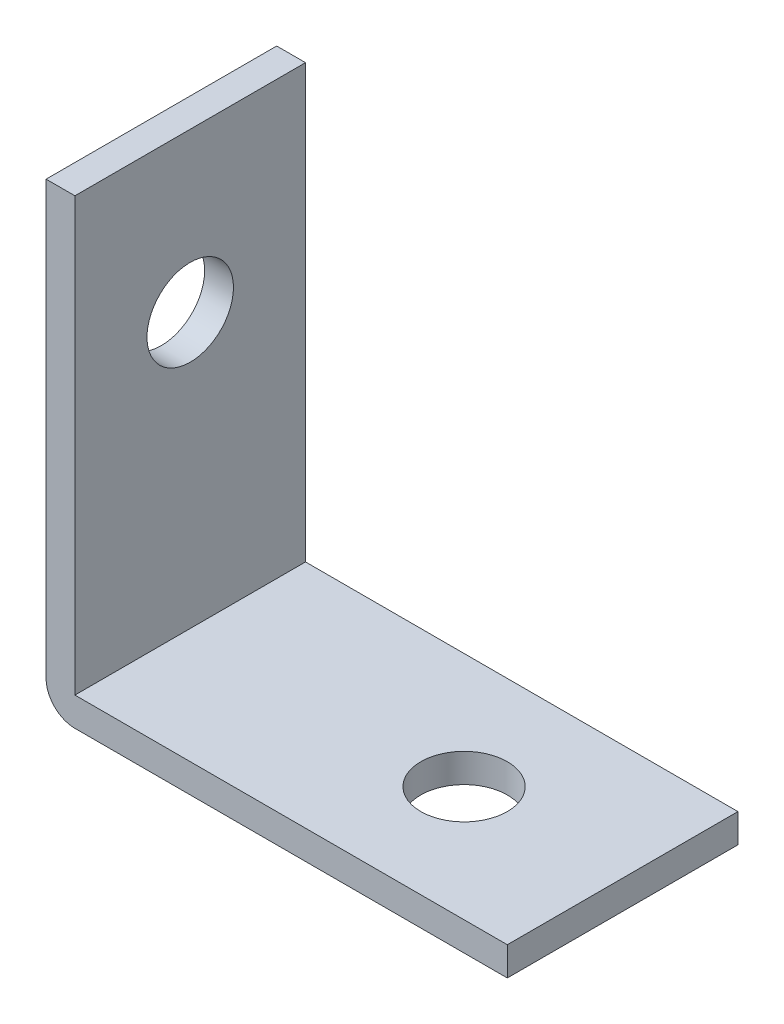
ISO-10303-21;
HEADER;
FILE_DESCRIPTION(('STEP AP214'),'2;1');
FILE_NAME('part.step','',(''),(''),'','','');
FILE_SCHEMA(('AUTOMOTIVE_DESIGN { 1 0 10303 214 1 1 1 1 }'));
ENDSEC;
DATA;
#1=APPLICATION_CONTEXT('core data for automotive mechanical design processes');
#2=APPLICATION_PROTOCOL_DEFINITION('international standard','automotive_design',2000,#1);
#3=PRODUCT_CONTEXT('',#1,'mechanical');
#4=PRODUCT('Part','Part','',(#3));
#5=PRODUCT_RELATED_PRODUCT_CATEGORY('part','',(#4));
#6=PRODUCT_DEFINITION_FORMATION('','',#4);
#7=PRODUCT_DEFINITION_CONTEXT('part definition',#1,'design');
#8=PRODUCT_DEFINITION('design','',#6,#7);
#9=PRODUCT_DEFINITION_SHAPE('','',#8);
#10=(LENGTH_UNIT() NAMED_UNIT(*) SI_UNIT(.MILLI.,.METRE.));
#11=(NAMED_UNIT(*) PLANE_ANGLE_UNIT() SI_UNIT($,.RADIAN.));
#12=(NAMED_UNIT(*) SI_UNIT($,.STERADIAN.) SOLID_ANGLE_UNIT());
#13=UNCERTAINTY_MEASURE_WITH_UNIT(LENGTH_MEASURE(1.E-05),#10,'distance_accuracy_value','');
#14=(GEOMETRIC_REPRESENTATION_CONTEXT(3) GLOBAL_UNCERTAINTY_ASSIGNED_CONTEXT((#13)) GLOBAL_UNIT_ASSIGNED_CONTEXT((#10,
#11,#12)) REPRESENTATION_CONTEXT('',''));
#15=CARTESIAN_POINT('',(0.,0.,0.));
#16=DIRECTION('',(0.,0.,1.));
#17=DIRECTION('',(1.,0.,0.));
#18=AXIS2_PLACEMENT_3D('',#15,#16,#17);
#19=CARTESIAN_POINT('',(0.,0.,0.));
#20=DIRECTION('',(0.,-1.,0.));
#21=DIRECTION('',(0.,0.,-1.));
#22=AXIS2_PLACEMENT_3D('',#19,#20,#21);
#23=PLANE('',#22);
#24=CARTESIAN_POINT('',(16.66875,0.,0.));
#25=DIRECTION('',(0.,1.,0.));
#26=DIRECTION('',(0.,0.,1.));
#27=AXIS2_PLACEMENT_3D('',#24,#25,#26);
#28=CIRCLE('',#27,2.38125);
#29=CARTESIAN_POINT('',(16.66875,0.,2.38125));
#30=VERTEX_POINT('',#29);
#31=EDGE_CURVE('E139',#30,#30,#28,.T.);
#32=ORIENTED_EDGE('',*,*,#31,.F.);
#33=EDGE_LOOP('',(#32));
#34=FACE_BOUND('',#33,.T.);
#35=DIRECTION('',(0.,0.,-1.));
#36=VECTOR('',#35,1.);
#37=CARTESIAN_POINT('',(1.5875,0.,-6.35));
#38=LINE('',#37,#36);
#39=CARTESIAN_POINT('',(1.5875,0.,6.35));
#40=VERTEX_POINT('',#39);
#41=CARTESIAN_POINT('',(1.5875,0.,-6.35));
#42=VERTEX_POINT('',#41);
#43=EDGE_CURVE('E124',#40,#42,#38,.T.);
#44=ORIENTED_EDGE('',*,*,#43,.F.);
#45=DIRECTION('',(1.,0.,0.));
#46=VECTOR('',#45,1.);
#47=CARTESIAN_POINT('',(0.,0.,6.35));
#48=LINE('',#47,#46);
#49=CARTESIAN_POINT('',(25.4,0.,6.34999999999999));
#50=VERTEX_POINT('',#49);
#51=EDGE_CURVE('E155',#40,#50,#48,.T.);
#52=ORIENTED_EDGE('',*,*,#51,.T.);
#53=DIRECTION('',(0.,0.,-1.));
#54=VECTOR('',#53,1.);
#55=CARTESIAN_POINT('',(25.4,0.,-6.35000000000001));
#56=LINE('',#55,#54);
#57=CARTESIAN_POINT('',(25.4,0.,-6.35000000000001));
#58=VERTEX_POINT('',#57);
#59=EDGE_CURVE('E149',#50,#58,#56,.T.);
#60=ORIENTED_EDGE('',*,*,#59,.T.);
#61=DIRECTION('',(-1.,0.,0.));
#62=VECTOR('',#61,1.);
#63=CARTESIAN_POINT('',(0.,0.,-6.35));
#64=LINE('',#63,#62);
#65=EDGE_CURVE('E143',#58,#42,#64,.T.);
#66=ORIENTED_EDGE('',*,*,#65,.T.);
#67=EDGE_LOOP('',(#44,#52,#60,#66));
#68=FACE_BOUND('',#67,.T.);
#69=ADVANCED_FACE('F41',(#34,#68),#23,.F.);
#70=CARTESIAN_POINT('',(0.,-1.5875,-6.35));
#71=DIRECTION('',(0.,0.,-1.));
#72=DIRECTION('',(-1.,0.,0.));
#73=AXIS2_PLACEMENT_3D('',#70,#71,#72);
#74=PLANE('',#73);
#75=DIRECTION('',(-1.,0.,0.));
#76=VECTOR('',#75,1.);
#77=CARTESIAN_POINT('',(0.,-1.5875,-6.35));
#78=LINE('',#77,#76);
#79=CARTESIAN_POINT('',(25.4,-1.5875,-6.35000000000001));
#80=VERTEX_POINT('',#79);
#81=CARTESIAN_POINT('',(1.5875,-1.5875,-6.35));
#82=VERTEX_POINT('',#81);
#83=EDGE_CURVE('E146',#80,#82,#78,.T.);
#84=ORIENTED_EDGE('',*,*,#83,.T.);
#85=CARTESIAN_POINT('',(1.5875,0.,-6.35));
#86=DIRECTION('',(0.,0.,-1.));
#87=DIRECTION('',(-1.,0.,0.));
#88=AXIS2_PLACEMENT_3D('',#85,#86,#87);
#89=CIRCLE('',#88,1.5875);
#90=CARTESIAN_POINT('',(0.,0.,-6.35));
#91=VERTEX_POINT('',#90);
#92=EDGE_CURVE('E11',#82,#91,#89,.T.);
#93=ORIENTED_EDGE('',*,*,#92,.T.);
#94=DIRECTION('',(0.,1.,0.));
#95=VECTOR('',#94,1.);
#96=CARTESIAN_POINT('',(0.,-1.5875,-6.35));
#97=LINE('',#96,#95);
#98=CARTESIAN_POINT('',(0.,23.8125,-6.35));
#99=VERTEX_POINT('',#98);
#100=EDGE_CURVE('E108',#91,#99,#97,.T.);
#101=ORIENTED_EDGE('',*,*,#100,.T.);
#102=DIRECTION('',(-1.,0.,0.));
#103=VECTOR('',#102,1.);
#104=CARTESIAN_POINT('',(0.,23.8125,-6.35));
#105=LINE('',#104,#103);
#106=CARTESIAN_POINT('',(1.5875,23.8125,-6.35));
#107=VERTEX_POINT('',#106);
#108=EDGE_CURVE('E123',#107,#99,#105,.T.);
#109=ORIENTED_EDGE('',*,*,#108,.F.);
#110=DIRECTION('',(0.,-1.,0.));
#111=VECTOR('',#110,1.);
#112=CARTESIAN_POINT('',(1.5875,23.8125,-6.35));
#113=LINE('',#112,#111);
#114=EDGE_CURVE('E134',#107,#42,#113,.T.);
#115=ORIENTED_EDGE('',*,*,#114,.T.);
#116=ORIENTED_EDGE('',*,*,#65,.F.);
#117=DIRECTION('',(0.,1.,0.));
#118=VECTOR('',#117,1.);
#119=CARTESIAN_POINT('',(25.4,-1.5875,-6.35000000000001));
#120=LINE('',#119,#118);
#121=EDGE_CURVE('E159',#80,#58,#120,.T.);
#122=ORIENTED_EDGE('',*,*,#121,.F.);
#123=EDGE_LOOP('',(#84,#93,#101,#109,#115,#116,#122));
#124=FACE_BOUND('',#123,.T.);
#125=ADVANCED_FACE('F166',(#124),#74,.T.);
#126=CARTESIAN_POINT('',(25.4,-1.5875,-6.35000000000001));
#127=DIRECTION('',(1.,0.,0.));
#128=DIRECTION('',(0.,0.,-1.));
#129=AXIS2_PLACEMENT_3D('',#126,#127,#128);
#130=PLANE('',#129);
#131=ORIENTED_EDGE('',*,*,#59,.F.);
#132=DIRECTION('',(0.,1.,0.));
#133=VECTOR('',#132,1.);
#134=CARTESIAN_POINT('',(25.4,-1.5875,6.34999999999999));
#135=LINE('',#134,#133);
#136=CARTESIAN_POINT('',(25.4,-1.5875,6.34999999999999));
#137=VERTEX_POINT('',#136);
#138=EDGE_CURVE('E107',#137,#50,#135,.T.);
#139=ORIENTED_EDGE('',*,*,#138,.F.);
#140=DIRECTION('',(0.,0.,-1.));
#141=VECTOR('',#140,1.);
#142=CARTESIAN_POINT('',(25.4,-1.5875,-6.35000000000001));
#143=LINE('',#142,#141);
#144=EDGE_CURVE('E151',#137,#80,#143,.T.);
#145=ORIENTED_EDGE('',*,*,#144,.T.);
#146=ORIENTED_EDGE('',*,*,#121,.T.);
#147=EDGE_LOOP('',(#131,#139,#145,#146));
#148=FACE_BOUND('',#147,.T.);
#149=ADVANCED_FACE('F182',(#148),#130,.T.);
#150=CARTESIAN_POINT('',(0.,-1.5875,6.35));
#151=DIRECTION('',(0.,0.,1.));
#152=DIRECTION('',(1.,0.,0.));
#153=AXIS2_PLACEMENT_3D('',#150,#151,#152);
#154=PLANE('',#153);
#155=DIRECTION('',(0.,1.,0.));
#156=VECTOR('',#155,1.);
#157=CARTESIAN_POINT('',(0.,-1.5875,6.35));
#158=LINE('',#157,#156);
#159=CARTESIAN_POINT('',(0.,0.,6.35));
#160=VERTEX_POINT('',#159);
#161=CARTESIAN_POINT('',(0.,23.8125,6.35));
#162=VERTEX_POINT('',#161);
#163=EDGE_CURVE('E99',#160,#162,#158,.T.);
#164=ORIENTED_EDGE('',*,*,#163,.F.);
#165=CARTESIAN_POINT('',(1.5875,0.,6.35));
#166=DIRECTION('',(0.,0.,1.));
#167=DIRECTION('',(1.,0.,0.));
#168=AXIS2_PLACEMENT_3D('',#165,#166,#167);
#169=CIRCLE('',#168,1.5875);
#170=CARTESIAN_POINT('',(1.5875,-1.5875,6.35));
#171=VERTEX_POINT('',#170);
#172=EDGE_CURVE('E63',#160,#171,#169,.T.);
#173=ORIENTED_EDGE('',*,*,#172,.T.);
#174=DIRECTION('',(1.,0.,0.));
#175=VECTOR('',#174,1.);
#176=CARTESIAN_POINT('',(0.,-1.5875,6.35));
#177=LINE('',#176,#175);
#178=EDGE_CURVE('E148',#171,#137,#177,.T.);
#179=ORIENTED_EDGE('',*,*,#178,.T.);
#180=ORIENTED_EDGE('',*,*,#138,.T.);
#181=ORIENTED_EDGE('',*,*,#51,.F.);
#182=DIRECTION('',(0.,-1.,0.));
#183=VECTOR('',#182,1.);
#184=CARTESIAN_POINT('',(1.5875,23.8125,6.35));
#185=LINE('',#184,#183);
#186=CARTESIAN_POINT('',(1.5875,23.8125,6.35));
#187=VERTEX_POINT('',#186);
#188=EDGE_CURVE('E115',#187,#40,#185,.T.);
#189=ORIENTED_EDGE('',*,*,#188,.F.);
#190=DIRECTION('',(1.,0.,0.));
#191=VECTOR('',#190,1.);
#192=CARTESIAN_POINT('',(0.,23.8125,6.35));
#193=LINE('',#192,#191);
#194=EDGE_CURVE('E111',#162,#187,#193,.T.);
#195=ORIENTED_EDGE('',*,*,#194,.F.);
#196=EDGE_LOOP('',(#164,#173,#179,#180,#181,#189,#195));
#197=FACE_BOUND('',#196,.T.);
#198=ADVANCED_FACE('F112',(#197),#154,.T.);
#199=CARTESIAN_POINT('',(0.,-1.5875,-6.35));
#200=DIRECTION('',(-1.,0.,0.));
#201=DIRECTION('',(0.,0.,1.));
#202=AXIS2_PLACEMENT_3D('',#199,#200,#201);
#203=PLANE('',#202);
#204=CARTESIAN_POINT('',(0.,15.08125,0.));
#205=DIRECTION('',(1.,0.,0.));
#206=DIRECTION('',(0.,0.,-1.));
#207=AXIS2_PLACEMENT_3D('',#204,#205,#206);
#208=CIRCLE('',#207,2.38125);
#209=CARTESIAN_POINT('',(0.,15.08125,-2.38125));
#210=VERTEX_POINT('',#209);
#211=EDGE_CURVE('E127',#210,#210,#208,.T.);
#212=ORIENTED_EDGE('',*,*,#211,.T.);
#213=EDGE_LOOP('',(#212));
#214=FACE_BOUND('',#213,.T.);
#215=ORIENTED_EDGE('',*,*,#100,.F.);
#216=DIRECTION('',(0.,0.,1.));
#217=VECTOR('',#216,1.);
#218=CARTESIAN_POINT('',(0.,0.,-6.35));
#219=LINE('',#218,#217);
#220=EDGE_CURVE('E106',#91,#160,#219,.T.);
#221=ORIENTED_EDGE('',*,*,#220,.T.);
#222=ORIENTED_EDGE('',*,*,#163,.T.);
#223=DIRECTION('',(0.,0.,1.));
#224=VECTOR('',#223,1.);
#225=CARTESIAN_POINT('',(0.,23.8125,-6.35));
#226=LINE('',#225,#224);
#227=EDGE_CURVE('E104',#99,#162,#226,.T.);
#228=ORIENTED_EDGE('',*,*,#227,.F.);
#229=EDGE_LOOP('',(#215,#221,#222,#228));
#230=FACE_BOUND('',#229,.T.);
#231=ADVANCED_FACE('F102',(#214,#230),#203,.T.);
#232=CARTESIAN_POINT('',(0.,-1.5875,0.));
#233=DIRECTION('',(0.,-1.,0.));
#234=DIRECTION('',(0.,0.,-1.));
#235=AXIS2_PLACEMENT_3D('',#232,#233,#234);
#236=PLANE('',#235);
#237=CARTESIAN_POINT('',(16.66875,-1.5875,0.));
#238=DIRECTION('',(0.,1.,0.));
#239=DIRECTION('',(0.,0.,1.));
#240=AXIS2_PLACEMENT_3D('',#237,#238,#239);
#241=CIRCLE('',#240,2.38125);
#242=CARTESIAN_POINT('',(16.66875,-1.5875,2.38125));
#243=VERTEX_POINT('',#242);
#244=EDGE_CURVE('E140',#243,#243,#241,.T.);
#245=ORIENTED_EDGE('',*,*,#244,.T.);
#246=EDGE_LOOP('',(#245));
#247=FACE_BOUND('',#246,.T.);
#248=ORIENTED_EDGE('',*,*,#178,.F.);
#249=DIRECTION('',(0.,0.,1.));
#250=VECTOR('',#249,1.);
#251=CARTESIAN_POINT('',(1.5875,-1.5875,0.));
#252=LINE('',#251,#250);
#253=EDGE_CURVE('E49',#171,#82,#252,.F.);
#254=ORIENTED_EDGE('',*,*,#253,.T.);
#255=ORIENTED_EDGE('',*,*,#83,.F.);
#256=ORIENTED_EDGE('',*,*,#144,.F.);
#257=EDGE_LOOP('',(#248,#254,#255,#256));
#258=FACE_BOUND('',#257,.T.);
#259=ADVANCED_FACE('F187',(#247,#258),#236,.T.);
#260=CARTESIAN_POINT('',(16.66875,-1.5875,0.));
#261=DIRECTION('',(0.,1.,0.));
#262=DIRECTION('',(0.,0.,1.));
#263=AXIS2_PLACEMENT_3D('',#260,#261,#262);
#264=CYLINDRICAL_SURFACE('',#263,2.38125);
#265=ORIENTED_EDGE('',*,*,#244,.F.);
#266=EDGE_LOOP('',(#265));
#267=FACE_BOUND('',#266,.T.);
#268=ORIENTED_EDGE('',*,*,#31,.T.);
#269=EDGE_LOOP('',(#268));
#270=FACE_BOUND('',#269,.T.);
#271=ADVANCED_FACE('F199',(#267,#270),#264,.F.);
#272=CARTESIAN_POINT('',(1.5875,23.8125,-6.35));
#273=DIRECTION('',(-1.,0.,0.));
#274=DIRECTION('',(0.,0.,1.));
#275=AXIS2_PLACEMENT_3D('',#272,#273,#274);
#276=PLANE('',#275);
#277=CARTESIAN_POINT('',(1.5875,15.08125,0.));
#278=DIRECTION('',(1.,0.,0.));
#279=DIRECTION('',(0.,0.,-1.));
#280=AXIS2_PLACEMENT_3D('',#277,#278,#279);
#281=CIRCLE('',#280,2.38125);
#282=CARTESIAN_POINT('',(1.5875,15.08125,-2.38125));
#283=VERTEX_POINT('',#282);
#284=EDGE_CURVE('E130',#283,#283,#281,.T.);
#285=ORIENTED_EDGE('',*,*,#284,.F.);
#286=EDGE_LOOP('',(#285));
#287=FACE_BOUND('',#286,.T.);
#288=ORIENTED_EDGE('',*,*,#43,.T.);
#289=ORIENTED_EDGE('',*,*,#114,.F.);
#290=DIRECTION('',(0.,0.,-1.));
#291=VECTOR('',#290,1.);
#292=CARTESIAN_POINT('',(1.5875,23.8125,-6.35));
#293=LINE('',#292,#291);
#294=EDGE_CURVE('E118',#187,#107,#293,.T.);
#295=ORIENTED_EDGE('',*,*,#294,.F.);
#296=ORIENTED_EDGE('',*,*,#188,.T.);
#297=EDGE_LOOP('',(#288,#289,#295,#296));
#298=FACE_BOUND('',#297,.T.);
#299=ADVANCED_FACE('F207',(#287,#298),#276,.F.);
#300=CARTESIAN_POINT('',(0.,23.8125,0.));
#301=DIRECTION('',(0.,1.,0.));
#302=DIRECTION('',(0.,0.,1.));
#303=AXIS2_PLACEMENT_3D('',#300,#301,#302);
#304=PLANE('',#303);
#305=ORIENTED_EDGE('',*,*,#227,.T.);
#306=ORIENTED_EDGE('',*,*,#194,.T.);
#307=ORIENTED_EDGE('',*,*,#294,.T.);
#308=ORIENTED_EDGE('',*,*,#108,.T.);
#309=EDGE_LOOP('',(#305,#306,#307,#308));
#310=FACE_BOUND('',#309,.T.);
#311=ADVANCED_FACE('F121',(#310),#304,.T.);
#312=CARTESIAN_POINT('',(0.,15.08125,0.));
#313=DIRECTION('',(1.,0.,0.));
#314=DIRECTION('',(0.,0.,-1.));
#315=AXIS2_PLACEMENT_3D('',#312,#313,#314);
#316=CYLINDRICAL_SURFACE('',#315,2.38125);
#317=ORIENTED_EDGE('',*,*,#211,.F.);
#318=EDGE_LOOP('',(#317));
#319=FACE_BOUND('',#318,.T.);
#320=ORIENTED_EDGE('',*,*,#284,.T.);
#321=EDGE_LOOP('',(#320));
#322=FACE_BOUND('',#321,.T.);
#323=ADVANCED_FACE('F170',(#319,#322),#316,.F.);
#324=CARTESIAN_POINT('',(1.5875,0.,-6.35));
#325=DIRECTION('',(0.,0.,1.));
#326=DIRECTION('',(1.,0.,0.));
#327=AXIS2_PLACEMENT_3D('',#324,#325,#326);
#328=CYLINDRICAL_SURFACE('',#327,1.5875);
#329=ORIENTED_EDGE('',*,*,#92,.F.);
#330=ORIENTED_EDGE('',*,*,#253,.F.);
#331=ORIENTED_EDGE('',*,*,#172,.F.);
#332=ORIENTED_EDGE('',*,*,#220,.F.);
#333=EDGE_LOOP('',(#329,#330,#331,#332));
#334=FACE_BOUND('',#333,.T.);
#335=ADVANCED_FACE('F43',(#334),#328,.T.);
#336=CLOSED_SHELL('',(#69,#125,#149,#198,#231,#259,#271,#299,#311,#323,#335));
#337=MANIFOLD_SOLID_BREP('B2',#336);
#338=ADVANCED_BREP_SHAPE_REPRESENTATION('',(#18,#337),#14);
#339=SHAPE_DEFINITION_REPRESENTATION(#9,#338);
ENDSEC;
END-ISO-10303-21;
